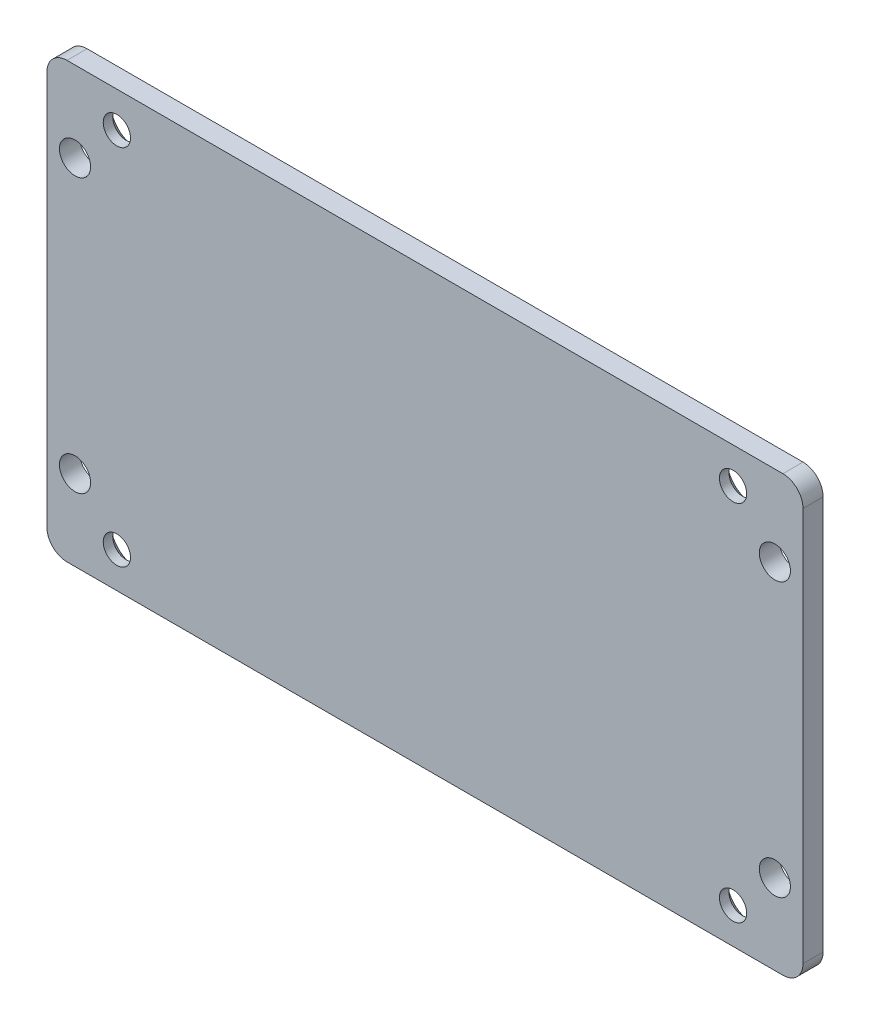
ISO-10303-21;
HEADER;
FILE_DESCRIPTION(('STEP AP214'),'2;1');
FILE_NAME('part.step','',(''),(''),'','','');
FILE_SCHEMA(('AUTOMOTIVE_DESIGN { 1 0 10303 214 1 1 1 1 }'));
ENDSEC;
DATA;
#1=APPLICATION_CONTEXT('core data for automotive mechanical design processes');
#2=APPLICATION_PROTOCOL_DEFINITION('international standard','automotive_design',2000,#1);
#3=PRODUCT_CONTEXT('',#1,'mechanical');
#4=PRODUCT('Part','Part','',(#3));
#5=PRODUCT_RELATED_PRODUCT_CATEGORY('part','',(#4));
#6=PRODUCT_DEFINITION_FORMATION('','',#4);
#7=PRODUCT_DEFINITION_CONTEXT('part definition',#1,'design');
#8=PRODUCT_DEFINITION('design','',#6,#7);
#9=PRODUCT_DEFINITION_SHAPE('','',#8);
#10=(LENGTH_UNIT() NAMED_UNIT(*) SI_UNIT(.MILLI.,.METRE.));
#11=(NAMED_UNIT(*) PLANE_ANGLE_UNIT() SI_UNIT($,.RADIAN.));
#12=(NAMED_UNIT(*) SI_UNIT($,.STERADIAN.) SOLID_ANGLE_UNIT());
#13=UNCERTAINTY_MEASURE_WITH_UNIT(LENGTH_MEASURE(1.E-05),#10,'distance_accuracy_value','');
#14=(GEOMETRIC_REPRESENTATION_CONTEXT(3) GLOBAL_UNCERTAINTY_ASSIGNED_CONTEXT((#13)) GLOBAL_UNIT_ASSIGNED_CONTEXT((#10,
#11,#12)) REPRESENTATION_CONTEXT('',''));
#15=CARTESIAN_POINT('',(0.,0.,0.));
#16=DIRECTION('',(0.,0.,1.));
#17=DIRECTION('',(1.,0.,0.));
#18=AXIS2_PLACEMENT_3D('',#15,#16,#17);
#19=CARTESIAN_POINT('',(-56.515,31.115,3.175));
#20=DIRECTION('',(0.,0.,-1.));
#21=DIRECTION('',(-1.,0.,0.));
#22=AXIS2_PLACEMENT_3D('',#19,#20,#21);
#23=CYLINDRICAL_SURFACE('',#22,3.17500000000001);
#24=CARTESIAN_POINT('',(-56.515,31.115,0.));
#25=DIRECTION('',(0.,0.,1.));
#26=DIRECTION('',(-1.,0.,0.));
#27=AXIS2_PLACEMENT_3D('',#24,#25,#26);
#28=CIRCLE('',#27,3.17500000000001);
#29=CARTESIAN_POINT('',(-56.515,34.29,0.));
#30=VERTEX_POINT('',#29);
#31=CARTESIAN_POINT('',(-59.69,31.1149999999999,0.));
#32=VERTEX_POINT('',#31);
#33=EDGE_CURVE('E156',#30,#32,#28,.T.);
#34=ORIENTED_EDGE('',*,*,#33,.T.);
#35=DIRECTION('',(0.,0.,-1.));
#36=VECTOR('',#35,1.);
#37=CARTESIAN_POINT('',(-59.69,31.1149999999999,3.175));
#38=LINE('',#37,#36);
#39=CARTESIAN_POINT('',(-59.69,31.1149999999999,3.175));
#40=VERTEX_POINT('',#39);
#41=EDGE_CURVE('E11',#40,#32,#38,.T.);
#42=ORIENTED_EDGE('',*,*,#41,.F.);
#43=CARTESIAN_POINT('',(-56.515,31.115,3.175));
#44=DIRECTION('',(0.,0.,1.));
#45=DIRECTION('',(-1.,0.,0.));
#46=AXIS2_PLACEMENT_3D('',#43,#44,#45);
#47=CIRCLE('',#46,3.17500000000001);
#48=CARTESIAN_POINT('',(-56.515,34.29,3.175));
#49=VERTEX_POINT('',#48);
#50=EDGE_CURVE('E178',#49,#40,#47,.T.);
#51=ORIENTED_EDGE('',*,*,#50,.F.);
#52=DIRECTION('',(0.,0.,-1.));
#53=VECTOR('',#52,1.);
#54=CARTESIAN_POINT('',(-56.515,34.29,3.175));
#55=LINE('',#54,#53);
#56=EDGE_CURVE('E152',#49,#30,#55,.T.);
#57=ORIENTED_EDGE('',*,*,#56,.T.);
#58=EDGE_LOOP('',(#34,#42,#51,#57));
#59=FACE_BOUND('',#58,.T.);
#60=ADVANCED_FACE('F43',(#59),#23,.T.);
#61=CARTESIAN_POINT('',(-59.69,-31.115,3.175));
#62=DIRECTION('',(1.,0.,0.));
#63=DIRECTION('',(0.,0.,-1.));
#64=AXIS2_PLACEMENT_3D('',#61,#62,#63);
#65=PLANE('',#64);
#66=DIRECTION('',(0.,-1.,0.));
#67=VECTOR('',#66,1.);
#68=CARTESIAN_POINT('',(-59.69,-31.115,0.));
#69=LINE('',#68,#67);
#70=CARTESIAN_POINT('',(-59.69,-31.115,0.));
#71=VERTEX_POINT('',#70);
#72=EDGE_CURVE('E160',#32,#71,#69,.T.);
#73=ORIENTED_EDGE('',*,*,#72,.T.);
#74=DIRECTION('',(0.,0.,-1.));
#75=VECTOR('',#74,1.);
#76=CARTESIAN_POINT('',(-59.69,-31.115,3.175));
#77=LINE('',#76,#75);
#78=CARTESIAN_POINT('',(-59.69,-31.115,3.175));
#79=VERTEX_POINT('',#78);
#80=EDGE_CURVE('E53',#79,#71,#77,.T.);
#81=ORIENTED_EDGE('',*,*,#80,.F.);
#82=DIRECTION('',(0.,-1.,0.));
#83=VECTOR('',#82,1.);
#84=CARTESIAN_POINT('',(-59.69,-31.115,3.175));
#85=LINE('',#84,#83);
#86=EDGE_CURVE('E113',#40,#79,#85,.T.);
#87=ORIENTED_EDGE('',*,*,#86,.F.);
#88=ORIENTED_EDGE('',*,*,#41,.T.);
#89=EDGE_LOOP('',(#73,#81,#87,#88));
#90=FACE_BOUND('',#89,.T.);
#91=ADVANCED_FACE('F314',(#90),#65,.F.);
#92=CARTESIAN_POINT('',(-56.515,-31.115,3.175));
#93=DIRECTION('',(0.,0.,-1.));
#94=DIRECTION('',(-1.,0.,0.));
#95=AXIS2_PLACEMENT_3D('',#92,#93,#94);
#96=CYLINDRICAL_SURFACE('',#95,3.17500000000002);
#97=CARTESIAN_POINT('',(-56.515,-31.115,0.));
#98=DIRECTION('',(0.,0.,1.));
#99=DIRECTION('',(1.,0.,0.));
#100=AXIS2_PLACEMENT_3D('',#97,#98,#99);
#101=CIRCLE('',#100,3.17500000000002);
#102=CARTESIAN_POINT('',(-56.515,-34.29,0.));
#103=VERTEX_POINT('',#102);
#104=EDGE_CURVE('E164',#71,#103,#101,.T.);
#105=ORIENTED_EDGE('',*,*,#104,.T.);
#106=DIRECTION('',(0.,0.,-1.));
#107=VECTOR('',#106,1.);
#108=CARTESIAN_POINT('',(-56.515,-34.29,3.175));
#109=LINE('',#108,#107);
#110=CARTESIAN_POINT('',(-56.515,-34.29,3.175));
#111=VERTEX_POINT('',#110);
#112=EDGE_CURVE('E188',#111,#103,#109,.T.);
#113=ORIENTED_EDGE('',*,*,#112,.F.);
#114=CARTESIAN_POINT('',(-56.515,-31.115,3.175));
#115=DIRECTION('',(0.,0.,1.));
#116=DIRECTION('',(1.,0.,0.));
#117=AXIS2_PLACEMENT_3D('',#114,#115,#116);
#118=CIRCLE('',#117,3.17500000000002);
#119=EDGE_CURVE('E235',#79,#111,#118,.T.);
#120=ORIENTED_EDGE('',*,*,#119,.F.);
#121=ORIENTED_EDGE('',*,*,#80,.T.);
#122=EDGE_LOOP('',(#105,#113,#120,#121));
#123=FACE_BOUND('',#122,.T.);
#124=ADVANCED_FACE('F318',(#123),#96,.T.);
#125=CARTESIAN_POINT('',(-56.515,-34.29,3.175));
#126=DIRECTION('',(0.,1.,0.));
#127=DIRECTION('',(0.,0.,1.));
#128=AXIS2_PLACEMENT_3D('',#125,#126,#127);
#129=PLANE('',#128);
#130=DIRECTION('',(1.,0.,0.));
#131=VECTOR('',#130,1.);
#132=CARTESIAN_POINT('',(-56.515,-34.29,0.));
#133=LINE('',#132,#131);
#134=CARTESIAN_POINT('',(56.515,-34.29,0.));
#135=VERTEX_POINT('',#134);
#136=EDGE_CURVE('E167',#103,#135,#133,.T.);
#137=ORIENTED_EDGE('',*,*,#136,.T.);
#138=DIRECTION('',(0.,0.,-1.));
#139=VECTOR('',#138,1.);
#140=CARTESIAN_POINT('',(56.515,-34.29,3.175));
#141=LINE('',#140,#139);
#142=CARTESIAN_POINT('',(56.515,-34.29,3.175));
#143=VERTEX_POINT('',#142);
#144=EDGE_CURVE('E184',#143,#135,#141,.T.);
#145=ORIENTED_EDGE('',*,*,#144,.F.);
#146=DIRECTION('',(1.,0.,0.));
#147=VECTOR('',#146,1.);
#148=CARTESIAN_POINT('',(-56.515,-34.29,3.175));
#149=LINE('',#148,#147);
#150=EDGE_CURVE('E238',#111,#143,#149,.T.);
#151=ORIENTED_EDGE('',*,*,#150,.F.);
#152=ORIENTED_EDGE('',*,*,#112,.T.);
#153=EDGE_LOOP('',(#137,#145,#151,#152));
#154=FACE_BOUND('',#153,.T.);
#155=ADVANCED_FACE('F322',(#154),#129,.F.);
#156=CARTESIAN_POINT('',(56.515,-31.115,3.175));
#157=DIRECTION('',(0.,0.,-1.));
#158=DIRECTION('',(-1.,0.,0.));
#159=AXIS2_PLACEMENT_3D('',#156,#157,#158);
#160=CYLINDRICAL_SURFACE('',#159,3.17500000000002);
#161=CARTESIAN_POINT('',(56.515,-31.115,0.));
#162=DIRECTION('',(0.,0.,1.));
#163=DIRECTION('',(1.,0.,0.));
#164=AXIS2_PLACEMENT_3D('',#161,#162,#163);
#165=CIRCLE('',#164,3.17500000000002);
#166=CARTESIAN_POINT('',(59.69,-31.115,0.));
#167=VERTEX_POINT('',#166);
#168=EDGE_CURVE('E170',#135,#167,#165,.T.);
#169=ORIENTED_EDGE('',*,*,#168,.T.);
#170=DIRECTION('',(0.,0.,-1.));
#171=VECTOR('',#170,1.);
#172=CARTESIAN_POINT('',(59.69,-31.115,3.175));
#173=LINE('',#172,#171);
#174=CARTESIAN_POINT('',(59.69,-31.115,3.175));
#175=VERTEX_POINT('',#174);
#176=EDGE_CURVE('E146',#175,#167,#173,.T.);
#177=ORIENTED_EDGE('',*,*,#176,.F.);
#178=CARTESIAN_POINT('',(56.515,-31.115,3.175));
#179=DIRECTION('',(0.,0.,1.));
#180=DIRECTION('',(1.,0.,0.));
#181=AXIS2_PLACEMENT_3D('',#178,#179,#180);
#182=CIRCLE('',#181,3.17500000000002);
#183=EDGE_CURVE('E136',#143,#175,#182,.T.);
#184=ORIENTED_EDGE('',*,*,#183,.F.);
#185=ORIENTED_EDGE('',*,*,#144,.T.);
#186=EDGE_LOOP('',(#169,#177,#184,#185));
#187=FACE_BOUND('',#186,.T.);
#188=ADVANCED_FACE('F328',(#187),#160,.T.);
#189=CARTESIAN_POINT('',(59.69,-31.115,3.175));
#190=DIRECTION('',(-1.,0.,0.));
#191=DIRECTION('',(0.,0.,1.));
#192=AXIS2_PLACEMENT_3D('',#189,#190,#191);
#193=PLANE('',#192);
#194=DIRECTION('',(0.,1.,0.));
#195=VECTOR('',#194,1.);
#196=CARTESIAN_POINT('',(59.69,-31.115,0.));
#197=LINE('',#196,#195);
#198=CARTESIAN_POINT('',(59.69,31.1149999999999,0.));
#199=VERTEX_POINT('',#198);
#200=EDGE_CURVE('E145',#167,#199,#197,.T.);
#201=ORIENTED_EDGE('',*,*,#200,.T.);
#202=DIRECTION('',(0.,0.,-1.));
#203=VECTOR('',#202,1.);
#204=CARTESIAN_POINT('',(59.69,31.1149999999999,3.175));
#205=LINE('',#204,#203);
#206=CARTESIAN_POINT('',(59.69,31.1149999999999,3.175));
#207=VERTEX_POINT('',#206);
#208=EDGE_CURVE('E142',#207,#199,#205,.T.);
#209=ORIENTED_EDGE('',*,*,#208,.F.);
#210=DIRECTION('',(0.,1.,0.));
#211=VECTOR('',#210,1.);
#212=CARTESIAN_POINT('',(59.69,-31.115,3.175));
#213=LINE('',#212,#211);
#214=EDGE_CURVE('E130',#175,#207,#213,.T.);
#215=ORIENTED_EDGE('',*,*,#214,.F.);
#216=ORIENTED_EDGE('',*,*,#176,.T.);
#217=EDGE_LOOP('',(#201,#209,#215,#216));
#218=FACE_BOUND('',#217,.T.);
#219=ADVANCED_FACE('F143',(#218),#193,.F.);
#220=CARTESIAN_POINT('',(56.515,31.115,3.175));
#221=DIRECTION('',(0.,0.,-1.));
#222=DIRECTION('',(-1.,0.,0.));
#223=AXIS2_PLACEMENT_3D('',#220,#221,#222);
#224=CYLINDRICAL_SURFACE('',#223,3.17500000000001);
#225=CARTESIAN_POINT('',(56.515,31.115,0.));
#226=DIRECTION('',(0.,0.,1.));
#227=DIRECTION('',(-1.,0.,0.));
#228=AXIS2_PLACEMENT_3D('',#225,#226,#227);
#229=CIRCLE('',#228,3.17500000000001);
#230=CARTESIAN_POINT('',(56.515,34.29,0.));
#231=VERTEX_POINT('',#230);
#232=EDGE_CURVE('E98',#199,#231,#229,.T.);
#233=ORIENTED_EDGE('',*,*,#232,.T.);
#234=DIRECTION('',(0.,0.,-1.));
#235=VECTOR('',#234,1.);
#236=CARTESIAN_POINT('',(56.515,34.29,3.175));
#237=LINE('',#236,#235);
#238=CARTESIAN_POINT('',(56.515,34.29,3.175));
#239=VERTEX_POINT('',#238);
#240=EDGE_CURVE('E147',#239,#231,#237,.T.);
#241=ORIENTED_EDGE('',*,*,#240,.F.);
#242=CARTESIAN_POINT('',(56.515,31.115,3.175));
#243=DIRECTION('',(0.,0.,1.));
#244=DIRECTION('',(-1.,0.,0.));
#245=AXIS2_PLACEMENT_3D('',#242,#243,#244);
#246=CIRCLE('',#245,3.17500000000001);
#247=EDGE_CURVE('E134',#207,#239,#246,.T.);
#248=ORIENTED_EDGE('',*,*,#247,.F.);
#249=ORIENTED_EDGE('',*,*,#208,.T.);
#250=EDGE_LOOP('',(#233,#241,#248,#249));
#251=FACE_BOUND('',#250,.T.);
#252=ADVANCED_FACE('F149',(#251),#224,.T.);
#253=CARTESIAN_POINT('',(-56.515,34.29,3.175));
#254=DIRECTION('',(0.,-1.,0.));
#255=DIRECTION('',(0.,0.,-1.));
#256=AXIS2_PLACEMENT_3D('',#253,#254,#255);
#257=PLANE('',#256);
#258=DIRECTION('',(-1.,0.,0.));
#259=VECTOR('',#258,1.);
#260=CARTESIAN_POINT('',(-56.515,34.29,0.));
#261=LINE('',#260,#259);
#262=EDGE_CURVE('E104',#231,#30,#261,.T.);
#263=ORIENTED_EDGE('',*,*,#262,.T.);
#264=ORIENTED_EDGE('',*,*,#56,.F.);
#265=DIRECTION('',(-1.,0.,0.));
#266=VECTOR('',#265,1.);
#267=CARTESIAN_POINT('',(-56.515,34.29,3.175));
#268=LINE('',#267,#266);
#269=EDGE_CURVE('E65',#239,#49,#268,.T.);
#270=ORIENTED_EDGE('',*,*,#269,.F.);
#271=ORIENTED_EDGE('',*,*,#240,.T.);
#272=EDGE_LOOP('',(#263,#264,#270,#271));
#273=FACE_BOUND('',#272,.T.);
#274=ADVANCED_FACE('F303',(#273),#257,.F.);
#275=CARTESIAN_POINT('',(-56.515,31.115,3.175));
#276=DIRECTION('',(0.,0.,-1.));
#277=DIRECTION('',(-1.,0.,0.));
#278=AXIS2_PLACEMENT_3D('',#275,#276,#277);
#279=PLANE('',#278);
#280=CARTESIAN_POINT('',(-55.245,-21.59,3.175));
#281=DIRECTION('',(0.,0.,1.));
#282=DIRECTION('',(1.,0.,0.));
#283=AXIS2_PLACEMENT_3D('',#280,#281,#282);
#284=CIRCLE('',#283,2.45745);
#285=CARTESIAN_POINT('',(-52.78755,-21.59,3.175));
#286=VERTEX_POINT('',#285);
#287=EDGE_CURVE('E260',#286,#286,#284,.T.);
#288=ORIENTED_EDGE('',*,*,#287,.F.);
#289=EDGE_LOOP('',(#288));
#290=FACE_BOUND('',#289,.T.);
#291=CARTESIAN_POINT('',(55.245,-21.59,3.175));
#292=DIRECTION('',(0.,0.,1.));
#293=DIRECTION('',(1.,0.,0.));
#294=AXIS2_PLACEMENT_3D('',#291,#292,#293);
#295=CIRCLE('',#294,2.45745);
#296=CARTESIAN_POINT('',(57.70245,-21.59,3.175));
#297=VERTEX_POINT('',#296);
#298=EDGE_CURVE('E246',#297,#297,#295,.T.);
#299=ORIENTED_EDGE('',*,*,#298,.F.);
#300=EDGE_LOOP('',(#299));
#301=FACE_BOUND('',#300,.T.);
#302=CARTESIAN_POINT('',(55.245,21.59,3.175));
#303=DIRECTION('',(0.,0.,1.));
#304=DIRECTION('',(1.,0.,0.));
#305=AXIS2_PLACEMENT_3D('',#302,#303,#304);
#306=CIRCLE('',#305,2.45745);
#307=CARTESIAN_POINT('',(57.70245,21.59,3.175));
#308=VERTEX_POINT('',#307);
#309=EDGE_CURVE('E245',#308,#308,#306,.T.);
#310=ORIENTED_EDGE('',*,*,#309,.F.);
#311=EDGE_LOOP('',(#310));
#312=FACE_BOUND('',#311,.T.);
#313=CARTESIAN_POINT('',(-55.245,21.59,3.175));
#314=DIRECTION('',(0.,0.,1.));
#315=DIRECTION('',(1.,0.,0.));
#316=AXIS2_PLACEMENT_3D('',#313,#314,#315);
#317=CIRCLE('',#316,2.45745);
#318=CARTESIAN_POINT('',(-52.78755,21.59,3.175));
#319=VERTEX_POINT('',#318);
#320=EDGE_CURVE('E272',#319,#319,#317,.T.);
#321=ORIENTED_EDGE('',*,*,#320,.F.);
#322=EDGE_LOOP('',(#321));
#323=FACE_BOUND('',#322,.T.);
#324=CARTESIAN_POINT('',(48.641,-28.6766,3.175));
#325=DIRECTION('',(0.,0.,-1.));
#326=DIRECTION('',(-1.,0.,0.));
#327=AXIS2_PLACEMENT_3D('',#324,#325,#326);
#328=CIRCLE('',#327,2.15265);
#329=CARTESIAN_POINT('',(46.48835,-28.6766,3.175));
#330=VERTEX_POINT('',#329);
#331=EDGE_CURVE('E46',#330,#330,#328,.T.);
#332=ORIENTED_EDGE('',*,*,#331,.T.);
#333=EDGE_LOOP('',(#332));
#334=FACE_BOUND('',#333,.T.);
#335=CARTESIAN_POINT('',(48.641,28.6766,3.175));
#336=DIRECTION('',(0.,0.,-1.));
#337=DIRECTION('',(-1.,0.,0.));
#338=AXIS2_PLACEMENT_3D('',#335,#336,#337);
#339=CIRCLE('',#338,2.15265);
#340=CARTESIAN_POINT('',(46.48835,28.6766,3.175));
#341=VERTEX_POINT('',#340);
#342=EDGE_CURVE('E204',#341,#341,#339,.T.);
#343=ORIENTED_EDGE('',*,*,#342,.T.);
#344=EDGE_LOOP('',(#343));
#345=FACE_BOUND('',#344,.T.);
#346=CARTESIAN_POINT('',(-48.641,28.6766,3.175));
#347=DIRECTION('',(0.,0.,-1.));
#348=DIRECTION('',(-1.,0.,0.));
#349=AXIS2_PLACEMENT_3D('',#346,#347,#348);
#350=CIRCLE('',#349,2.15265);
#351=CARTESIAN_POINT('',(-50.79365,28.6766,3.175));
#352=VERTEX_POINT('',#351);
#353=EDGE_CURVE('E199',#352,#352,#350,.T.);
#354=ORIENTED_EDGE('',*,*,#353,.T.);
#355=EDGE_LOOP('',(#354));
#356=FACE_BOUND('',#355,.T.);
#357=CARTESIAN_POINT('',(-48.641,-28.6766,3.175));
#358=DIRECTION('',(0.,0.,-1.));
#359=DIRECTION('',(-1.,0.,0.));
#360=AXIS2_PLACEMENT_3D('',#357,#358,#359);
#361=CIRCLE('',#360,2.15265);
#362=CARTESIAN_POINT('',(-50.79365,-28.6766,3.175));
#363=VERTEX_POINT('',#362);
#364=EDGE_CURVE('E161',#363,#363,#361,.T.);
#365=ORIENTED_EDGE('',*,*,#364,.T.);
#366=EDGE_LOOP('',(#365));
#367=FACE_BOUND('',#366,.T.);
#368=ORIENTED_EDGE('',*,*,#50,.T.);
#369=ORIENTED_EDGE('',*,*,#86,.T.);
#370=ORIENTED_EDGE('',*,*,#119,.T.);
#371=ORIENTED_EDGE('',*,*,#150,.T.);
#372=ORIENTED_EDGE('',*,*,#183,.T.);
#373=ORIENTED_EDGE('',*,*,#214,.T.);
#374=ORIENTED_EDGE('',*,*,#247,.T.);
#375=ORIENTED_EDGE('',*,*,#269,.T.);
#376=EDGE_LOOP('',(#368,#369,#370,#371,#372,#373,#374,#375));
#377=FACE_BOUND('',#376,.T.);
#378=ADVANCED_FACE('F132',(#290,#301,#312,#323,#334,#345,#356,#367,#377),#279,.F.);
#379=CARTESIAN_POINT('',(-56.515,31.115,0.));
#380=DIRECTION('',(0.,0.,-1.));
#381=DIRECTION('',(-1.,0.,0.));
#382=AXIS2_PLACEMENT_3D('',#379,#380,#381);
#383=PLANE('',#382);
#384=CARTESIAN_POINT('',(-55.245,-21.59,0.));
#385=DIRECTION('',(0.,0.,1.));
#386=DIRECTION('',(1.,0.,0.));
#387=AXIS2_PLACEMENT_3D('',#384,#385,#386);
#388=CIRCLE('',#387,2.45745);
#389=CARTESIAN_POINT('',(-52.78755,-21.59,0.));
#390=VERTEX_POINT('',#389);
#391=EDGE_CURVE('E254',#390,#390,#388,.T.);
#392=ORIENTED_EDGE('',*,*,#391,.T.);
#393=EDGE_LOOP('',(#392));
#394=FACE_BOUND('',#393,.T.);
#395=CARTESIAN_POINT('',(55.245,-21.59,0.));
#396=DIRECTION('',(0.,0.,1.));
#397=DIRECTION('',(1.,0.,0.));
#398=AXIS2_PLACEMENT_3D('',#395,#396,#397);
#399=CIRCLE('',#398,2.45745);
#400=CARTESIAN_POINT('',(57.70245,-21.59,0.));
#401=VERTEX_POINT('',#400);
#402=EDGE_CURVE('E242',#401,#401,#399,.T.);
#403=ORIENTED_EDGE('',*,*,#402,.T.);
#404=EDGE_LOOP('',(#403));
#405=FACE_BOUND('',#404,.T.);
#406=CARTESIAN_POINT('',(55.245,21.59,0.));
#407=DIRECTION('',(0.,0.,1.));
#408=DIRECTION('',(1.,0.,0.));
#409=AXIS2_PLACEMENT_3D('',#406,#407,#408);
#410=CIRCLE('',#409,2.45745);
#411=CARTESIAN_POINT('',(57.70245,21.59,0.));
#412=VERTEX_POINT('',#411);
#413=EDGE_CURVE('E269',#412,#412,#410,.T.);
#414=ORIENTED_EDGE('',*,*,#413,.T.);
#415=EDGE_LOOP('',(#414));
#416=FACE_BOUND('',#415,.T.);
#417=CARTESIAN_POINT('',(-55.245,21.59,0.));
#418=DIRECTION('',(0.,0.,1.));
#419=DIRECTION('',(1.,0.,0.));
#420=AXIS2_PLACEMENT_3D('',#417,#418,#419);
#421=CIRCLE('',#420,2.45745);
#422=CARTESIAN_POINT('',(-52.78755,21.59,0.));
#423=VERTEX_POINT('',#422);
#424=EDGE_CURVE('E276',#423,#423,#421,.T.);
#425=ORIENTED_EDGE('',*,*,#424,.T.);
#426=EDGE_LOOP('',(#425));
#427=FACE_BOUND('',#426,.T.);
#428=CARTESIAN_POINT('',(48.641,-28.6766,0.));
#429=DIRECTION('',(0.,0.,-1.));
#430=DIRECTION('',(-1.,0.,0.));
#431=AXIS2_PLACEMENT_3D('',#428,#429,#430);
#432=CIRCLE('',#431,4.148709);
#433=CARTESIAN_POINT('',(44.492291,-28.6766,0.));
#434=VERTEX_POINT('',#433);
#435=EDGE_CURVE('E251',#434,#434,#432,.T.);
#436=ORIENTED_EDGE('',*,*,#435,.F.);
#437=EDGE_LOOP('',(#436));
#438=FACE_BOUND('',#437,.T.);
#439=CARTESIAN_POINT('',(48.641,28.6766,0.));
#440=DIRECTION('',(0.,0.,-1.));
#441=DIRECTION('',(-1.,0.,0.));
#442=AXIS2_PLACEMENT_3D('',#439,#440,#441);
#443=CIRCLE('',#442,4.148709);
#444=CARTESIAN_POINT('',(44.492291,28.6766,0.));
#445=VERTEX_POINT('',#444);
#446=EDGE_CURVE('E214',#445,#445,#443,.T.);
#447=ORIENTED_EDGE('',*,*,#446,.F.);
#448=EDGE_LOOP('',(#447));
#449=FACE_BOUND('',#448,.T.);
#450=CARTESIAN_POINT('',(-48.641,28.6766,0.));
#451=DIRECTION('',(0.,0.,-1.));
#452=DIRECTION('',(-1.,0.,0.));
#453=AXIS2_PLACEMENT_3D('',#450,#451,#452);
#454=CIRCLE('',#453,4.148709);
#455=CARTESIAN_POINT('',(-52.789709,28.6766,0.));
#456=VERTEX_POINT('',#455);
#457=EDGE_CURVE('E206',#456,#456,#454,.T.);
#458=ORIENTED_EDGE('',*,*,#457,.F.);
#459=EDGE_LOOP('',(#458));
#460=FACE_BOUND('',#459,.T.);
#461=CARTESIAN_POINT('',(-48.641,-28.6766,0.));
#462=DIRECTION('',(0.,0.,-1.));
#463=DIRECTION('',(-1.,0.,0.));
#464=AXIS2_PLACEMENT_3D('',#461,#462,#463);
#465=CIRCLE('',#464,4.148709);
#466=CARTESIAN_POINT('',(-52.789709,-28.6766,0.));
#467=VERTEX_POINT('',#466);
#468=EDGE_CURVE('E202',#467,#467,#465,.T.);
#469=ORIENTED_EDGE('',*,*,#468,.F.);
#470=EDGE_LOOP('',(#469));
#471=FACE_BOUND('',#470,.T.);
#472=ORIENTED_EDGE('',*,*,#33,.F.);
#473=ORIENTED_EDGE('',*,*,#262,.F.);
#474=ORIENTED_EDGE('',*,*,#232,.F.);
#475=ORIENTED_EDGE('',*,*,#200,.F.);
#476=ORIENTED_EDGE('',*,*,#168,.F.);
#477=ORIENTED_EDGE('',*,*,#136,.F.);
#478=ORIENTED_EDGE('',*,*,#104,.F.);
#479=ORIENTED_EDGE('',*,*,#72,.F.);
#480=EDGE_LOOP('',(#472,#473,#474,#475,#476,#477,#478,#479));
#481=FACE_BOUND('',#480,.T.);
#482=ADVANCED_FACE('F286',(#394,#405,#416,#427,#438,#449,#460,#471,#481),#383,.T.);
#483=CARTESIAN_POINT('',(-48.641,-28.6766,0.));
#484=DIRECTION('',(0.,0.,-1.));
#485=DIRECTION('',(-1.,0.,0.));
#486=AXIS2_PLACEMENT_3D('',#483,#484,#485);
#487=CYLINDRICAL_SURFACE('',#486,2.15265);
#488=CARTESIAN_POINT('',(-48.641,-28.6766,1.67489237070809));
#489=DIRECTION('',(0.,0.,-1.));
#490=DIRECTION('',(-1.,0.,0.));
#491=AXIS2_PLACEMENT_3D('',#488,#489,#490);
#492=CIRCLE('',#491,2.15265);
#493=CARTESIAN_POINT('',(-50.79365,-28.6766,1.67489237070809));
#494=VERTEX_POINT('',#493);
#495=EDGE_CURVE('E198',#494,#494,#492,.T.);
#496=ORIENTED_EDGE('',*,*,#495,.T.);
#497=EDGE_LOOP('',(#496));
#498=FACE_BOUND('',#497,.T.);
#499=ORIENTED_EDGE('',*,*,#364,.F.);
#500=EDGE_LOOP('',(#499));
#501=FACE_BOUND('',#500,.T.);
#502=ADVANCED_FACE('F289',(#498,#501),#487,.F.);
#503=CARTESIAN_POINT('',(-48.641,-28.6766,0.));
#504=DIRECTION('',(0.,0.,-1.));
#505=DIRECTION('',(-1.,0.,0.));
#506=AXIS2_PLACEMENT_3D('',#503,#504,#505);
#507=CONICAL_SURFACE('',#506,4.148709,0.872664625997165);
#508=ORIENTED_EDGE('',*,*,#495,.F.);
#509=EDGE_LOOP('',(#508));
#510=FACE_BOUND('',#509,.T.);
#511=ORIENTED_EDGE('',*,*,#468,.T.);
#512=EDGE_LOOP('',(#511));
#513=FACE_BOUND('',#512,.T.);
#514=ADVANCED_FACE('F356',(#510,#513),#507,.F.);
#515=CARTESIAN_POINT('',(-48.641,28.6766,0.));
#516=DIRECTION('',(0.,0.,-1.));
#517=DIRECTION('',(-1.,0.,0.));
#518=AXIS2_PLACEMENT_3D('',#515,#516,#517);
#519=CYLINDRICAL_SURFACE('',#518,2.15265);
#520=CARTESIAN_POINT('',(-48.641,28.6766,1.67489237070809));
#521=DIRECTION('',(0.,0.,-1.));
#522=DIRECTION('',(-1.,0.,0.));
#523=AXIS2_PLACEMENT_3D('',#520,#521,#522);
#524=CIRCLE('',#523,2.15265);
#525=CARTESIAN_POINT('',(-50.79365,28.6766,1.67489237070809));
#526=VERTEX_POINT('',#525);
#527=EDGE_CURVE('E203',#526,#526,#524,.T.);
#528=ORIENTED_EDGE('',*,*,#527,.T.);
#529=EDGE_LOOP('',(#528));
#530=FACE_BOUND('',#529,.T.);
#531=ORIENTED_EDGE('',*,*,#353,.F.);
#532=EDGE_LOOP('',(#531));
#533=FACE_BOUND('',#532,.T.);
#534=ADVANCED_FACE('F367',(#530,#533),#519,.F.);
#535=CARTESIAN_POINT('',(-48.641,28.6766,0.));
#536=DIRECTION('',(0.,0.,-1.));
#537=DIRECTION('',(-1.,0.,0.));
#538=AXIS2_PLACEMENT_3D('',#535,#536,#537);
#539=CONICAL_SURFACE('',#538,4.148709,0.872664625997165);
#540=ORIENTED_EDGE('',*,*,#527,.F.);
#541=EDGE_LOOP('',(#540));
#542=FACE_BOUND('',#541,.T.);
#543=ORIENTED_EDGE('',*,*,#457,.T.);
#544=EDGE_LOOP('',(#543));
#545=FACE_BOUND('',#544,.T.);
#546=ADVANCED_FACE('F377',(#542,#545),#539,.F.);
#547=CARTESIAN_POINT('',(48.641,28.6766,0.));
#548=DIRECTION('',(0.,0.,-1.));
#549=DIRECTION('',(-1.,0.,0.));
#550=AXIS2_PLACEMENT_3D('',#547,#548,#549);
#551=CYLINDRICAL_SURFACE('',#550,2.15265);
#552=CARTESIAN_POINT('',(48.641,28.6766,1.67489237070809));
#553=DIRECTION('',(0.,0.,-1.));
#554=DIRECTION('',(-1.,0.,0.));
#555=AXIS2_PLACEMENT_3D('',#552,#553,#554);
#556=CIRCLE('',#555,2.15265);
#557=CARTESIAN_POINT('',(46.48835,28.6766,1.67489237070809));
#558=VERTEX_POINT('',#557);
#559=EDGE_CURVE('E207',#558,#558,#556,.T.);
#560=ORIENTED_EDGE('',*,*,#559,.T.);
#561=EDGE_LOOP('',(#560));
#562=FACE_BOUND('',#561,.T.);
#563=ORIENTED_EDGE('',*,*,#342,.F.);
#564=EDGE_LOOP('',(#563));
#565=FACE_BOUND('',#564,.T.);
#566=ADVANCED_FACE('F387',(#562,#565),#551,.F.);
#567=CARTESIAN_POINT('',(48.641,28.6766,0.));
#568=DIRECTION('',(0.,0.,-1.));
#569=DIRECTION('',(-1.,0.,0.));
#570=AXIS2_PLACEMENT_3D('',#567,#568,#569);
#571=CONICAL_SURFACE('',#570,4.148709,0.872664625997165);
#572=ORIENTED_EDGE('',*,*,#559,.F.);
#573=EDGE_LOOP('',(#572));
#574=FACE_BOUND('',#573,.T.);
#575=ORIENTED_EDGE('',*,*,#446,.T.);
#576=EDGE_LOOP('',(#575));
#577=FACE_BOUND('',#576,.T.);
#578=ADVANCED_FACE('F397',(#574,#577),#571,.F.);
#579=CARTESIAN_POINT('',(48.641,-28.6766,0.));
#580=DIRECTION('',(0.,0.,-1.));
#581=DIRECTION('',(-1.,0.,0.));
#582=AXIS2_PLACEMENT_3D('',#579,#580,#581);
#583=CYLINDRICAL_SURFACE('',#582,2.15265);
#584=CARTESIAN_POINT('',(48.641,-28.6766,1.67489237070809));
#585=DIRECTION('',(0.,0.,-1.));
#586=DIRECTION('',(-1.,0.,0.));
#587=AXIS2_PLACEMENT_3D('',#584,#585,#586);
#588=CIRCLE('',#587,2.15265);
#589=CARTESIAN_POINT('',(46.48835,-28.6766,1.67489237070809));
#590=VERTEX_POINT('',#589);
#591=EDGE_CURVE('E248',#590,#590,#588,.T.);
#592=ORIENTED_EDGE('',*,*,#591,.T.);
#593=EDGE_LOOP('',(#592));
#594=FACE_BOUND('',#593,.T.);
#595=ORIENTED_EDGE('',*,*,#331,.F.);
#596=EDGE_LOOP('',(#595));
#597=FACE_BOUND('',#596,.T.);
#598=ADVANCED_FACE('F406',(#594,#597),#583,.F.);
#599=CARTESIAN_POINT('',(48.641,-28.6766,0.));
#600=DIRECTION('',(0.,0.,-1.));
#601=DIRECTION('',(-1.,0.,0.));
#602=AXIS2_PLACEMENT_3D('',#599,#600,#601);
#603=CONICAL_SURFACE('',#602,4.148709,0.872664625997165);
#604=ORIENTED_EDGE('',*,*,#591,.F.);
#605=EDGE_LOOP('',(#604));
#606=FACE_BOUND('',#605,.T.);
#607=ORIENTED_EDGE('',*,*,#435,.T.);
#608=EDGE_LOOP('',(#607));
#609=FACE_BOUND('',#608,.T.);
#610=ADVANCED_FACE('F284',(#606,#609),#603,.F.);
#611=CARTESIAN_POINT('',(-55.245,21.59,3.175));
#612=DIRECTION('',(0.,0.,1.));
#613=DIRECTION('',(1.,0.,0.));
#614=AXIS2_PLACEMENT_3D('',#611,#612,#613);
#615=CYLINDRICAL_SURFACE('',#614,2.45745);
#616=ORIENTED_EDGE('',*,*,#424,.F.);
#617=EDGE_LOOP('',(#616));
#618=FACE_BOUND('',#617,.T.);
#619=ORIENTED_EDGE('',*,*,#320,.T.);
#620=EDGE_LOOP('',(#619));
#621=FACE_BOUND('',#620,.T.);
#622=ADVANCED_FACE('F425',(#618,#621),#615,.F.);
#623=CARTESIAN_POINT('',(55.245,21.59,3.175));
#624=DIRECTION('',(0.,0.,1.));
#625=DIRECTION('',(1.,0.,0.));
#626=AXIS2_PLACEMENT_3D('',#623,#624,#625);
#627=CYLINDRICAL_SURFACE('',#626,2.45745);
#628=ORIENTED_EDGE('',*,*,#413,.F.);
#629=EDGE_LOOP('',(#628));
#630=FACE_BOUND('',#629,.T.);
#631=ORIENTED_EDGE('',*,*,#309,.T.);
#632=EDGE_LOOP('',(#631));
#633=FACE_BOUND('',#632,.T.);
#634=ADVANCED_FACE('F445',(#630,#633),#627,.F.);
#635=CARTESIAN_POINT('',(55.245,-21.59,3.175));
#636=DIRECTION('',(0.,0.,1.));
#637=DIRECTION('',(1.,0.,0.));
#638=AXIS2_PLACEMENT_3D('',#635,#636,#637);
#639=CYLINDRICAL_SURFACE('',#638,2.45745);
#640=ORIENTED_EDGE('',*,*,#402,.F.);
#641=EDGE_LOOP('',(#640));
#642=FACE_BOUND('',#641,.T.);
#643=ORIENTED_EDGE('',*,*,#298,.T.);
#644=EDGE_LOOP('',(#643));
#645=FACE_BOUND('',#644,.T.);
#646=ADVANCED_FACE('F455',(#642,#645),#639,.F.);
#647=CARTESIAN_POINT('',(-55.245,-21.59,3.175));
#648=DIRECTION('',(0.,0.,1.));
#649=DIRECTION('',(1.,0.,0.));
#650=AXIS2_PLACEMENT_3D('',#647,#648,#649);
#651=CYLINDRICAL_SURFACE('',#650,2.45745);
#652=ORIENTED_EDGE('',*,*,#391,.F.);
#653=EDGE_LOOP('',(#652));
#654=FACE_BOUND('',#653,.T.);
#655=ORIENTED_EDGE('',*,*,#287,.T.);
#656=EDGE_LOOP('',(#655));
#657=FACE_BOUND('',#656,.T.);
#658=ADVANCED_FACE('F465',(#654,#657),#651,.F.);
#659=CLOSED_SHELL('',(#60,#91,#124,#155,#188,#219,#252,#274,#378,#482,#502,#514,#534,#546,#566,
#578,#598,#610,#622,#634,#646,#658));
#660=MANIFOLD_SOLID_BREP('B2',#659);
#661=ADVANCED_BREP_SHAPE_REPRESENTATION('',(#18,#660),#14);
#662=SHAPE_DEFINITION_REPRESENTATION(#9,#661);
ENDSEC;
END-ISO-10303-21;
